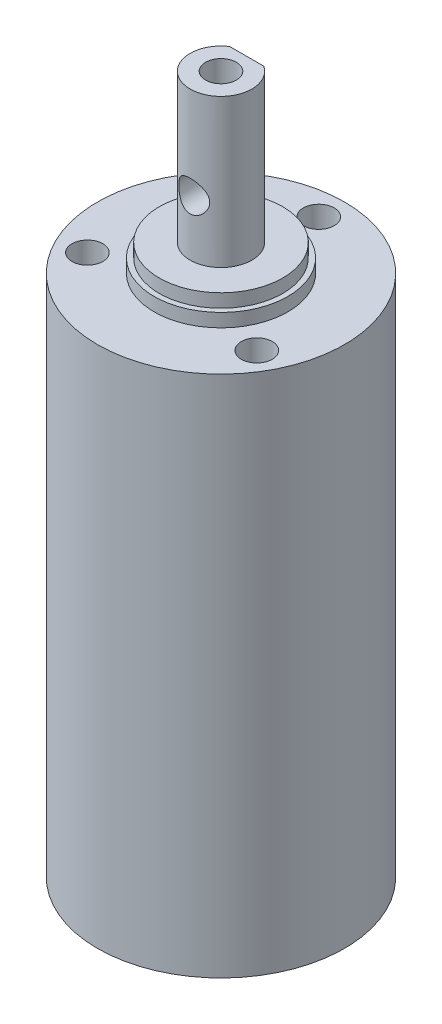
ISO-10303-21;
HEADER;
FILE_DESCRIPTION(('STEP AP214'),'2;1');
FILE_NAME('part.step','',(''),(''),'','','');
FILE_SCHEMA(('AUTOMOTIVE_DESIGN { 1 0 10303 214 1 1 1 1 }'));
ENDSEC;
DATA;
#1=APPLICATION_CONTEXT('core data for automotive mechanical design processes');
#2=APPLICATION_PROTOCOL_DEFINITION('international standard','automotive_design',2000,#1);
#3=PRODUCT_CONTEXT('',#1,'mechanical');
#4=PRODUCT('Part','Part','',(#3));
#5=PRODUCT_RELATED_PRODUCT_CATEGORY('part','',(#4));
#6=PRODUCT_DEFINITION_FORMATION('','',#4);
#7=PRODUCT_DEFINITION_CONTEXT('part definition',#1,'design');
#8=PRODUCT_DEFINITION('design','',#6,#7);
#9=PRODUCT_DEFINITION_SHAPE('','',#8);
#10=(LENGTH_UNIT() NAMED_UNIT(*) SI_UNIT(.MILLI.,.METRE.));
#11=(NAMED_UNIT(*) PLANE_ANGLE_UNIT() SI_UNIT($,.RADIAN.));
#12=(NAMED_UNIT(*) SI_UNIT($,.STERADIAN.) SOLID_ANGLE_UNIT());
#13=UNCERTAINTY_MEASURE_WITH_UNIT(LENGTH_MEASURE(1.E-05),#10,'distance_accuracy_value','');
#14=(GEOMETRIC_REPRESENTATION_CONTEXT(3) GLOBAL_UNCERTAINTY_ASSIGNED_CONTEXT((#13)) GLOBAL_UNIT_ASSIGNED_CONTEXT((#10,
#11,#12)) REPRESENTATION_CONTEXT('',''));
#15=CARTESIAN_POINT('',(0.,0.,0.));
#16=DIRECTION('',(0.,0.,1.));
#17=DIRECTION('',(1.,0.,0.));
#18=AXIS2_PLACEMENT_3D('',#15,#16,#17);
#19=CARTESIAN_POINT('',(0.,0.,0.));
#20=DIRECTION('',(0.,-1.,0.));
#21=DIRECTION('',(0.,0.,-1.));
#22=AXIS2_PLACEMENT_3D('',#19,#20,#21);
#23=CYLINDRICAL_SURFACE('',#22,3.);
#24=CARTESIAN_POINT('',(-1.5,62.8,2.59807621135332));
#25=CARTESIAN_POINT('',(-1.4999945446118,62.8781617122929,2.59808302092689));
#26=CARTESIAN_POINT('',(-1.49384995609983,62.9564221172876,2.60165701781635));
#27=CARTESIAN_POINT('',(-1.46958481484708,63.1105408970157,2.61543549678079));
#28=CARTESIAN_POINT('',(-1.45143909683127,63.1863938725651,2.62565391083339));
#29=CARTESIAN_POINT('',(-1.40414992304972,63.3331774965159,2.65124019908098));
#30=CARTESIAN_POINT('',(-1.37506492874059,63.4041319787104,2.66658065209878));
#31=CARTESIAN_POINT('',(-1.30690128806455,63.5401363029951,2.70063997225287));
#32=CARTESIAN_POINT('',(-1.26782210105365,63.6051858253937,2.71935902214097));
#33=CARTESIAN_POINT('',(-1.17699981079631,63.7334585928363,2.75995303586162));
#34=CARTESIAN_POINT('',(-1.12447805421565,63.7960887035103,2.78196095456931));
#35=CARTESIAN_POINT('',(-1.00988071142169,63.9121125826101,2.82557974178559));
#36=CARTESIAN_POINT('',(-0.947800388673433,63.9655017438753,2.84719040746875));
#37=CARTESIAN_POINT('',(-0.810734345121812,64.0650507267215,2.88932215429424));
#38=CARTESIAN_POINT('',(-0.735160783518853,64.1104806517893,2.90967159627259));
#39=CARTESIAN_POINT('',(-0.576235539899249,64.1877112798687,2.94526134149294));
#40=CARTESIAN_POINT('',(-0.49288880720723,64.2195205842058,2.96050486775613));
#41=CARTESIAN_POINT('',(-0.327067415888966,64.2662569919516,2.98320691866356));
#42=CARTESIAN_POINT('',(-0.244952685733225,64.2822242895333,2.99114220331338));
#43=CARTESIAN_POINT('',(-0.0788559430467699,64.3002491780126,3.00011375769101));
#44=CARTESIAN_POINT('',(0.00512490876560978,64.3023151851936,3.00115420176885));
#45=CARTESIAN_POINT('',(0.164748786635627,64.2928799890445,2.99644472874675));
#46=CARTESIAN_POINT('',(0.240481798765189,64.2825429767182,2.99127743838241));
#47=CARTESIAN_POINT('',(0.388970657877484,64.250678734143,2.97561367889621));
#48=CARTESIAN_POINT('',(0.461726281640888,64.2291506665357,2.96511681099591));
#49=CARTESIAN_POINT('',(0.603464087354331,64.1753761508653,2.93957374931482));
#50=CARTESIAN_POINT('',(0.67238013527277,64.1429855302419,2.92446662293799));
#51=CARTESIAN_POINT('',(0.803965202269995,64.0686048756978,2.89106468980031));
#52=CARTESIAN_POINT('',(0.86663197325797,64.0266114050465,2.87276874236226));
#53=CARTESIAN_POINT('',(0.99026049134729,63.9296569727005,2.83266591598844));
#54=CARTESIAN_POINT('',(1.05050111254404,63.873845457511,2.81069063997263));
#55=CARTESIAN_POINT('',(1.16115655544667,63.7531154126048,2.76681510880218));
#56=CARTESIAN_POINT('',(1.21156381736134,63.6881899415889,2.74491492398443));
#57=CARTESIAN_POINT('',(1.30425800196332,63.5460277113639,2.70216234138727));
#58=CARTESIAN_POINT('',(1.34582597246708,63.4682709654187,2.68146479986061));
#59=CARTESIAN_POINT('',(1.41497866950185,63.3055934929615,2.64563175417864));
#60=CARTESIAN_POINT('',(1.44257798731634,63.2206803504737,2.63049045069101));
#61=CARTESIAN_POINT('',(1.48077031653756,63.0531782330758,2.60916953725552));
#62=CARTESIAN_POINT('',(1.49253768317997,62.9709383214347,2.60237483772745));
#63=CARTESIAN_POINT('',(1.50227541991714,62.8053979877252,2.59676879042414));
#64=CARTESIAN_POINT('',(1.50025553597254,62.7220983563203,2.59795180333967));
#65=CARTESIAN_POINT('',(1.48355406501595,62.5665191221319,2.60751504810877));
#66=CARTESIAN_POINT('',(1.4702817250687,62.4940308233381,2.61509381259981));
#67=CARTESIAN_POINT('',(1.43354442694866,62.3524483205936,2.63541032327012));
#68=CARTESIAN_POINT('',(1.41007616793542,62.2833552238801,2.64814974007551));
#69=CARTESIAN_POINT('',(1.35247138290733,62.146883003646,2.67804333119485));
#70=CARTESIAN_POINT('',(1.31789109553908,62.0797314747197,2.69537464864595));
#71=CARTESIAN_POINT('',(1.2394305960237,61.9517960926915,2.73234179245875));
#72=CARTESIAN_POINT('',(1.19554560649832,61.8910155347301,2.75197880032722));
#73=CARTESIAN_POINT('',(1.09325575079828,61.7695318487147,2.79431997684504));
#74=CARTESIAN_POINT('',(1.03371790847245,61.7098042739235,2.81709874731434));
#75=CARTESIAN_POINT('',(0.905106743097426,61.6008816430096,2.86101352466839));
#76=CARTESIAN_POINT('',(0.836030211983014,61.5516901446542,2.88214897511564));
#77=CARTESIAN_POINT('',(0.687803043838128,61.4641394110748,2.92112042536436));
#78=CARTESIAN_POINT('',(0.608434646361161,61.4261003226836,2.93885462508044));
#79=CARTESIAN_POINT('',(0.443283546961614,61.3642931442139,2.96825032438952));
#80=CARTESIAN_POINT('',(0.357506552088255,61.3405125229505,2.9799171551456));
#81=CARTESIAN_POINT('',(0.190469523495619,61.309947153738,2.99501262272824));
#82=CARTESIAN_POINT('',(0.109517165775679,61.3018031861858,2.99909891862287));
#83=CARTESIAN_POINT('',(-0.0526889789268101,61.2987351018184,3.00063195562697));
#84=CARTESIAN_POINT('',(-0.133942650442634,61.3038063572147,2.99808102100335));
#85=CARTESIAN_POINT('',(-0.288806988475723,61.3261246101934,2.98700953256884));
#86=CARTESIAN_POINT('',(-0.362568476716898,61.3425472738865,2.97889342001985));
#87=CARTESIAN_POINT('',(-0.506168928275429,61.3859904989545,2.95788140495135));
#88=CARTESIAN_POINT('',(-0.576007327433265,61.4130125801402,2.94498481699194));
#89=CARTESIAN_POINT('',(-0.71313510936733,61.478090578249,2.9148889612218));
#90=CARTESIAN_POINT('',(-0.780187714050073,61.5165689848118,2.89752925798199));
#91=CARTESIAN_POINT('',(-0.907161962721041,61.6029368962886,2.86032199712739));
#92=CARTESIAN_POINT('',(-0.967080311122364,61.6508307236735,2.84047329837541));
#93=CARTESIAN_POINT('',(-1.08437100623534,61.7601957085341,2.79792915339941));
#94=CARTESIAN_POINT('',(-1.14089652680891,61.8225437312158,2.77514698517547));
#95=CARTESIAN_POINT('',(-1.24299493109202,61.9561760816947,2.73094614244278));
#96=CARTESIAN_POINT('',(-1.28855812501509,62.0274682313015,2.70952868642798));
#97=CARTESIAN_POINT('',(-1.36864661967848,62.1799549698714,2.66999407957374));
#98=CARTESIAN_POINT('',(-1.40277759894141,62.2613912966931,2.65200261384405));
#99=CARTESIAN_POINT('',(-1.45631806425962,62.4299986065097,2.62299234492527));
#100=CARTESIAN_POINT('',(-1.47577678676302,62.517149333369,2.61195024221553));
#101=CARTESIAN_POINT('',(-1.49155051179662,62.637708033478,2.60293908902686));
#102=CARTESIAN_POINT('',(-1.49471415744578,62.6700518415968,2.60112193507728));
#103=CARTESIAN_POINT('',(-1.49894010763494,62.7349247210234,2.59868903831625));
#104=CARTESIAN_POINT('',(-1.50000227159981,62.7674538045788,2.59807337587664));
#105=CARTESIAN_POINT('',(-1.5,62.8,2.59807621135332));
#106=B_SPLINE_CURVE_WITH_KNOTS('',3,(#24,#25,#26,#27,#28,#29,#30,#31,#32,#33,#34,#35,#36,#37,
#38,#39,#40,#41,#42,#43,#44,#45,#46,#47,#48,#49,#50,#51,#52,#53,#54,#55,#56,#57,#58,#59,#60,#61,
#62,#63,#64,#65,#66,#67,#68,#69,#70,#71,#72,#73,#74,#75,#76,#77,#78,#79,#80,#81,#82,#83,#84,#85,
#86,#87,#88,#89,#90,#91,#92,#93,#94,#95,#96,#97,#98,#99,#100,#101,#102,#103,#104,#105),
.UNSPECIFIED.,.T.,.F.,(4,2,2,2,2,2,2,2,2,2,2,2,2,2,2,2,2,2,2,2,2,2,2,2,2,2,2,2,2,2,2,2,2,2,2,2,
2,2,2,2,4),(0.,0.234348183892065,0.469189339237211,0.702792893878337,0.936409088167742,
1.18929346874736,1.44230356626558,1.71236838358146,1.98226240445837,2.23295227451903,
2.4834903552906,2.71224146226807,2.94100968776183,3.1729430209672,3.40495949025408,
3.65890787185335,3.91305072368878,4.18333262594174,4.45333161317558,4.70193436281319,
4.95036139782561,5.17161275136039,5.39293578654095,5.62450944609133,5.85620229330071,
6.11710115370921,6.37808797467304,6.6459627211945,6.91360169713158,7.15668405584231,
7.39968130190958,7.62666637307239,7.8536840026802,8.09041126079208,8.32724745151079,
8.58765362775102,8.84828914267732,9.11716123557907,9.38512699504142,9.48270202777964,
9.58028358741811),.UNSPECIFIED.);
#107=CARTESIAN_POINT('',(-1.5,62.8,2.59807621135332));
#108=VERTEX_POINT('',#107);
#109=EDGE_CURVE('E72',#108,#108,#106,.T.);
#110=ORIENTED_EDGE('',*,*,#109,.T.);
#111=EDGE_LOOP('',(#110));
#112=FACE_BOUND('',#111,.T.);
#113=DIRECTION('',(0.,-1.,0.));
#114=VECTOR('',#113,1.);
#115=CARTESIAN_POINT('',(1.6583123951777,260.822667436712,-2.5));
#116=LINE('',#115,#114);
#117=CARTESIAN_POINT('',(1.6583123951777,71.8,-2.5));
#118=VERTEX_POINT('',#117);
#119=CARTESIAN_POINT('',(1.6583123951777,57.4,-2.5));
#120=VERTEX_POINT('',#119);
#121=EDGE_CURVE('E66',#118,#120,#116,.T.);
#122=ORIENTED_EDGE('',*,*,#121,.F.);
#123=CARTESIAN_POINT('',(0.,71.8,0.));
#124=DIRECTION('',(0.,-1.,0.));
#125=DIRECTION('',(0.,0.,-1.));
#126=AXIS2_PLACEMENT_3D('',#123,#124,#125);
#127=CIRCLE('',#126,3.);
#128=CARTESIAN_POINT('',(-1.6583123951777,71.8,-2.5));
#129=VERTEX_POINT('',#128);
#130=EDGE_CURVE('E60',#118,#129,#127,.T.);
#131=ORIENTED_EDGE('',*,*,#130,.T.);
#132=DIRECTION('',(0.,-1.,0.));
#133=VECTOR('',#132,1.);
#134=CARTESIAN_POINT('',(-1.6583123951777,260.822667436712,-2.5));
#135=LINE('',#134,#133);
#136=CARTESIAN_POINT('',(-1.6583123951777,57.4,-2.5));
#137=VERTEX_POINT('',#136);
#138=EDGE_CURVE('E48',#129,#137,#135,.T.);
#139=ORIENTED_EDGE('',*,*,#138,.T.);
#140=CARTESIAN_POINT('',(0.,57.4,0.));
#141=DIRECTION('',(0.,-1.,0.));
#142=DIRECTION('',(0.,0.,-1.));
#143=AXIS2_PLACEMENT_3D('',#140,#141,#142);
#144=CIRCLE('',#143,3.);
#145=EDGE_CURVE('E52',#120,#137,#144,.T.);
#146=ORIENTED_EDGE('',*,*,#145,.F.);
#147=EDGE_LOOP('',(#122,#131,#139,#146));
#148=FACE_BOUND('',#147,.T.);
#149=ADVANCED_FACE('F33',(#112,#148),#23,.T.);
#150=CARTESIAN_POINT('',(0.,71.8,0.));
#151=DIRECTION('',(0.,-1.,0.));
#152=DIRECTION('',(0.,0.,-1.));
#153=AXIS2_PLACEMENT_3D('',#150,#151,#152);
#154=PLANE('',#153);
#155=CARTESIAN_POINT('',(0.,71.8,0.));
#156=DIRECTION('',(0.,1.,0.));
#157=DIRECTION('',(0.,0.,1.));
#158=AXIS2_PLACEMENT_3D('',#155,#156,#157);
#159=CIRCLE('',#158,1.5);
#160=CARTESIAN_POINT('',(0.,71.8,1.5));
#161=VERTEX_POINT('',#160);
#162=EDGE_CURVE('E206',#161,#161,#159,.T.);
#163=ORIENTED_EDGE('',*,*,#162,.F.);
#164=EDGE_LOOP('',(#163));
#165=FACE_BOUND('',#164,.T.);
#166=DIRECTION('',(-1.,0.,0.));
#167=VECTOR('',#166,1.);
#168=CARTESIAN_POINT('',(-1.6583123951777,71.8,-2.5));
#169=LINE('',#168,#167);
#170=EDGE_CURVE('E63',#118,#129,#169,.T.);
#171=ORIENTED_EDGE('',*,*,#170,.T.);
#172=ORIENTED_EDGE('',*,*,#130,.F.);
#173=EDGE_LOOP('',(#171,#172));
#174=FACE_BOUND('',#173,.T.);
#175=ADVANCED_FACE('F61',(#165,#174),#154,.F.);
#176=CARTESIAN_POINT('',(0.,0.,0.));
#177=DIRECTION('',(0.,-1.,0.));
#178=DIRECTION('',(0.,0.,-1.));
#179=AXIS2_PLACEMENT_3D('',#176,#177,#178);
#180=PLANE('',#179);
#181=CARTESIAN_POINT('',(0.,0.,0.));
#182=DIRECTION('',(0.,-1.,0.));
#183=DIRECTION('',(0.,0.,-1.));
#184=AXIS2_PLACEMENT_3D('',#181,#182,#183);
#185=CIRCLE('',#184,3.);
#186=CARTESIAN_POINT('',(0.,0.,-3.));
#187=VERTEX_POINT('',#186);
#188=EDGE_CURVE('E11',#187,#187,#185,.T.);
#189=ORIENTED_EDGE('',*,*,#188,.T.);
#190=EDGE_LOOP('',(#189));
#191=FACE_BOUND('',#190,.T.);
#192=ADVANCED_FACE('F35',(#191),#180,.T.);
#193=CARTESIAN_POINT('',(0.,0.,0.));
#194=DIRECTION('',(0.,-1.,0.));
#195=DIRECTION('',(0.,0.,-1.));
#196=AXIS2_PLACEMENT_3D('',#193,#194,#195);
#197=CYLINDRICAL_SURFACE('',#196,3.);
#198=CARTESIAN_POINT('',(0.,4.,0.));
#199=DIRECTION('',(0.,-1.,0.));
#200=DIRECTION('',(0.,0.,-1.));
#201=AXIS2_PLACEMENT_3D('',#198,#199,#200);
#202=CIRCLE('',#201,3.);
#203=CARTESIAN_POINT('',(0.,4.,-3.));
#204=VERTEX_POINT('',#203);
#205=EDGE_CURVE('E41',#204,#204,#202,.T.);
#206=ORIENTED_EDGE('',*,*,#205,.T.);
#207=EDGE_LOOP('',(#206));
#208=FACE_BOUND('',#207,.T.);
#209=ORIENTED_EDGE('',*,*,#188,.F.);
#210=EDGE_LOOP('',(#209));
#211=FACE_BOUND('',#210,.T.);
#212=ADVANCED_FACE('F101',(#208,#211),#197,.T.);
#213=CARTESIAN_POINT('',(0.,4.,0.));
#214=DIRECTION('',(0.,1.,0.));
#215=DIRECTION('',(0.,0.,1.));
#216=AXIS2_PLACEMENT_3D('',#213,#214,#215);
#217=PLANE('',#216);
#218=ORIENTED_EDGE('',*,*,#205,.F.);
#219=EDGE_LOOP('',(#218));
#220=FACE_BOUND('',#219,.T.);
#221=CARTESIAN_POINT('',(0.,4.,0.));
#222=DIRECTION('',(0.,-1.,0.));
#223=DIRECTION('',(0.,0.,-1.));
#224=AXIS2_PLACEMENT_3D('',#221,#222,#223);
#225=CIRCLE('',#224,12.);
#226=CARTESIAN_POINT('',(0.,4.,-12.));
#227=VERTEX_POINT('',#226);
#228=EDGE_CURVE('E96',#227,#227,#225,.T.);
#229=ORIENTED_EDGE('',*,*,#228,.T.);
#230=EDGE_LOOP('',(#229));
#231=FACE_BOUND('',#230,.T.);
#232=ADVANCED_FACE('F104',(#220,#231),#217,.F.);
#233=CARTESIAN_POINT('',(0.,0.,0.));
#234=DIRECTION('',(0.,-1.,0.));
#235=DIRECTION('',(0.,0.,-1.));
#236=AXIS2_PLACEMENT_3D('',#233,#234,#235);
#237=CYLINDRICAL_SURFACE('',#236,12.);
#238=ORIENTED_EDGE('',*,*,#228,.F.);
#239=EDGE_LOOP('',(#238));
#240=FACE_BOUND('',#239,.T.);
#241=CARTESIAN_POINT('',(0.,54.8,0.));
#242=DIRECTION('',(0.,-1.,0.));
#243=DIRECTION('',(0.,0.,-1.));
#244=AXIS2_PLACEMENT_3D('',#241,#242,#243);
#245=CIRCLE('',#244,12.);
#246=CARTESIAN_POINT('',(0.,54.8,-12.));
#247=VERTEX_POINT('',#246);
#248=EDGE_CURVE('E93',#247,#247,#245,.T.);
#249=ORIENTED_EDGE('',*,*,#248,.T.);
#250=EDGE_LOOP('',(#249));
#251=FACE_BOUND('',#250,.T.);
#252=ADVANCED_FACE('F107',(#240,#251),#237,.T.);
#253=CARTESIAN_POINT('',(0.,54.8,0.));
#254=DIRECTION('',(0.,-1.,0.));
#255=DIRECTION('',(0.,0.,-1.));
#256=AXIS2_PLACEMENT_3D('',#253,#254,#255);
#257=PLANE('',#256);
#258=CARTESIAN_POINT('',(0.,54.8,-9.5));
#259=DIRECTION('',(0.,1.,0.));
#260=DIRECTION('',(0.,0.,1.));
#261=AXIS2_PLACEMENT_3D('',#258,#259,#260);
#262=CIRCLE('',#261,1.5);
#263=CARTESIAN_POINT('',(0.,54.8,-8.));
#264=VERTEX_POINT('',#263);
#265=EDGE_CURVE('E207',#264,#264,#262,.T.);
#266=ORIENTED_EDGE('',*,*,#265,.F.);
#267=EDGE_LOOP('',(#266));
#268=FACE_BOUND('',#267,.T.);
#269=CARTESIAN_POINT('',(8.22724133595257,54.8,4.74999999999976));
#270=DIRECTION('',(0.,1.,0.));
#271=DIRECTION('',(0.,0.,1.));
#272=AXIS2_PLACEMENT_3D('',#269,#270,#271);
#273=CIRCLE('',#272,1.50000000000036);
#274=CARTESIAN_POINT('',(8.22724133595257,54.8,6.25000000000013));
#275=VERTEX_POINT('',#274);
#276=EDGE_CURVE('E217',#275,#275,#273,.T.);
#277=ORIENTED_EDGE('',*,*,#276,.F.);
#278=EDGE_LOOP('',(#277));
#279=FACE_BOUND('',#278,.T.);
#280=CARTESIAN_POINT('',(-8.22724133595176,54.8,4.75000000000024));
#281=DIRECTION('',(0.,1.,0.));
#282=DIRECTION('',(0.,0.,1.));
#283=AXIS2_PLACEMENT_3D('',#280,#281,#282);
#284=CIRCLE('',#283,1.50000000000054);
#285=CARTESIAN_POINT('',(-8.22724133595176,54.8,6.25000000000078));
#286=VERTEX_POINT('',#285);
#287=EDGE_CURVE('E223',#286,#286,#284,.T.);
#288=ORIENTED_EDGE('',*,*,#287,.F.);
#289=EDGE_LOOP('',(#288));
#290=FACE_BOUND('',#289,.T.);
#291=ORIENTED_EDGE('',*,*,#248,.F.);
#292=EDGE_LOOP('',(#291));
#293=FACE_BOUND('',#292,.T.);
#294=CARTESIAN_POINT('',(0.,54.8,0.));
#295=DIRECTION('',(0.,-1.,0.));
#296=DIRECTION('',(0.,0.,-1.));
#297=AXIS2_PLACEMENT_3D('',#294,#295,#296);
#298=CIRCLE('',#297,6.5);
#299=CARTESIAN_POINT('',(0.,54.8,-6.5));
#300=VERTEX_POINT('',#299);
#301=EDGE_CURVE('E90',#300,#300,#298,.T.);
#302=ORIENTED_EDGE('',*,*,#301,.T.);
#303=EDGE_LOOP('',(#302));
#304=FACE_BOUND('',#303,.T.);
#305=ADVANCED_FACE('F113',(#268,#279,#290,#293,#304),#257,.F.);
#306=CARTESIAN_POINT('',(0.,0.,0.));
#307=DIRECTION('',(0.,-1.,0.));
#308=DIRECTION('',(0.,0.,-1.));
#309=AXIS2_PLACEMENT_3D('',#306,#307,#308);
#310=CYLINDRICAL_SURFACE('',#309,6.5);
#311=ORIENTED_EDGE('',*,*,#301,.F.);
#312=EDGE_LOOP('',(#311));
#313=FACE_BOUND('',#312,.T.);
#314=CARTESIAN_POINT('',(0.,56.1,0.));
#315=DIRECTION('',(0.,-1.,0.));
#316=DIRECTION('',(0.,0.,-1.));
#317=AXIS2_PLACEMENT_3D('',#314,#315,#316);
#318=CIRCLE('',#317,6.5);
#319=CARTESIAN_POINT('',(0.,56.1,-6.5));
#320=VERTEX_POINT('',#319);
#321=EDGE_CURVE('E87',#320,#320,#318,.T.);
#322=ORIENTED_EDGE('',*,*,#321,.T.);
#323=EDGE_LOOP('',(#322));
#324=FACE_BOUND('',#323,.T.);
#325=ADVANCED_FACE('F119',(#313,#324),#310,.T.);
#326=CARTESIAN_POINT('',(0.,56.1,0.));
#327=DIRECTION('',(0.,-1.,0.));
#328=DIRECTION('',(0.,0.,-1.));
#329=AXIS2_PLACEMENT_3D('',#326,#327,#328);
#330=PLANE('',#329);
#331=ORIENTED_EDGE('',*,*,#321,.F.);
#332=EDGE_LOOP('',(#331));
#333=FACE_BOUND('',#332,.T.);
#334=CARTESIAN_POINT('',(0.,56.1,0.));
#335=DIRECTION('',(0.,-1.,0.));
#336=DIRECTION('',(0.,0.,-1.));
#337=AXIS2_PLACEMENT_3D('',#334,#335,#336);
#338=CIRCLE('',#337,6.);
#339=CARTESIAN_POINT('',(0.,56.1,-6.));
#340=VERTEX_POINT('',#339);
#341=EDGE_CURVE('E84',#340,#340,#338,.T.);
#342=ORIENTED_EDGE('',*,*,#341,.T.);
#343=EDGE_LOOP('',(#342));
#344=FACE_BOUND('',#343,.T.);
#345=ADVANCED_FACE('F126',(#333,#344),#330,.F.);
#346=CARTESIAN_POINT('',(0.,0.,0.));
#347=DIRECTION('',(0.,-1.,0.));
#348=DIRECTION('',(0.,0.,-1.));
#349=AXIS2_PLACEMENT_3D('',#346,#347,#348);
#350=CYLINDRICAL_SURFACE('',#349,6.);
#351=ORIENTED_EDGE('',*,*,#341,.F.);
#352=EDGE_LOOP('',(#351));
#353=FACE_BOUND('',#352,.T.);
#354=CARTESIAN_POINT('',(0.,57.4,0.));
#355=DIRECTION('',(0.,-1.,0.));
#356=DIRECTION('',(0.,0.,-1.));
#357=AXIS2_PLACEMENT_3D('',#354,#355,#356);
#358=CIRCLE('',#357,6.);
#359=CARTESIAN_POINT('',(0.,57.4,-6.));
#360=VERTEX_POINT('',#359);
#361=EDGE_CURVE('E81',#360,#360,#358,.T.);
#362=ORIENTED_EDGE('',*,*,#361,.T.);
#363=EDGE_LOOP('',(#362));
#364=FACE_BOUND('',#363,.T.);
#365=ADVANCED_FACE('F132',(#353,#364),#350,.T.);
#366=CARTESIAN_POINT('',(0.,57.4,0.));
#367=DIRECTION('',(0.,-1.,0.));
#368=DIRECTION('',(0.,0.,-1.));
#369=AXIS2_PLACEMENT_3D('',#366,#367,#368);
#370=PLANE('',#369);
#371=ORIENTED_EDGE('',*,*,#361,.F.);
#372=EDGE_LOOP('',(#371));
#373=FACE_BOUND('',#372,.T.);
#374=ORIENTED_EDGE('',*,*,#145,.T.);
#375=DIRECTION('',(-1.,0.,0.));
#376=VECTOR('',#375,1.);
#377=CARTESIAN_POINT('',(-1.6583123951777,57.4,-2.5));
#378=LINE('',#377,#376);
#379=EDGE_CURVE('E69',#120,#137,#378,.T.);
#380=ORIENTED_EDGE('',*,*,#379,.F.);
#381=EDGE_LOOP('',(#374,#380));
#382=FACE_BOUND('',#381,.T.);
#383=ADVANCED_FACE('F138',(#373,#382),#370,.F.);
#384=CARTESIAN_POINT('',(-1.6583123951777,260.822667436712,-2.5));
#385=DIRECTION('',(0.,0.,-1.));
#386=DIRECTION('',(-1.,0.,0.));
#387=AXIS2_PLACEMENT_3D('',#384,#385,#386);
#388=PLANE('',#387);
#389=CARTESIAN_POINT('',(0.,62.8,-2.5));
#390=DIRECTION('',(0.,0.,-1.));
#391=DIRECTION('',(-1.,0.,0.));
#392=AXIS2_PLACEMENT_3D('',#389,#390,#391);
#393=CIRCLE('',#392,1.5);
#394=CARTESIAN_POINT('',(-1.5,62.8,-2.5));
#395=VERTEX_POINT('',#394);
#396=EDGE_CURVE('E76',#395,#395,#393,.T.);
#397=ORIENTED_EDGE('',*,*,#396,.F.);
#398=EDGE_LOOP('',(#397));
#399=FACE_BOUND('',#398,.T.);
#400=ORIENTED_EDGE('',*,*,#170,.F.);
#401=ORIENTED_EDGE('',*,*,#121,.T.);
#402=ORIENTED_EDGE('',*,*,#379,.T.);
#403=ORIENTED_EDGE('',*,*,#138,.F.);
#404=EDGE_LOOP('',(#400,#401,#402,#403));
#405=FACE_BOUND('',#404,.T.);
#406=ADVANCED_FACE('F71',(#399,#405),#388,.T.);
#407=CARTESIAN_POINT('',(0.,62.8,12.));
#408=DIRECTION('',(0.,0.,-1.));
#409=DIRECTION('',(-1.,0.,0.));
#410=AXIS2_PLACEMENT_3D('',#407,#408,#409);
#411=CYLINDRICAL_SURFACE('',#410,1.5);
#412=ORIENTED_EDGE('',*,*,#396,.T.);
#413=EDGE_LOOP('',(#412));
#414=FACE_BOUND('',#413,.T.);
#415=ORIENTED_EDGE('',*,*,#109,.F.);
#416=EDGE_LOOP('',(#415));
#417=FACE_BOUND('',#416,.T.);
#418=ADVANCED_FACE('F148',(#414,#417),#411,.F.);
#419=CARTESIAN_POINT('',(0.,66.3,0.));
#420=DIRECTION('',(0.,1.,0.));
#421=DIRECTION('',(0.,0.,1.));
#422=AXIS2_PLACEMENT_3D('',#419,#420,#421);
#423=CYLINDRICAL_SURFACE('',#422,1.5);
#424=CARTESIAN_POINT('',(0.,66.3,0.));
#425=DIRECTION('',(0.,1.,0.));
#426=DIRECTION('',(0.,0.,1.));
#427=AXIS2_PLACEMENT_3D('',#424,#425,#426);
#428=CIRCLE('',#427,1.5);
#429=CARTESIAN_POINT('',(0.,66.3,1.5));
#430=VERTEX_POINT('',#429);
#431=EDGE_CURVE('E210',#430,#430,#428,.T.);
#432=ORIENTED_EDGE('',*,*,#431,.F.);
#433=EDGE_LOOP('',(#432));
#434=FACE_BOUND('',#433,.T.);
#435=ORIENTED_EDGE('',*,*,#162,.T.);
#436=EDGE_LOOP('',(#435));
#437=FACE_BOUND('',#436,.T.);
#438=ADVANCED_FACE('F169',(#434,#437),#423,.F.);
#439=CARTESIAN_POINT('',(0.,66.3,0.));
#440=DIRECTION('',(0.,1.,0.));
#441=DIRECTION('',(0.,0.,1.));
#442=AXIS2_PLACEMENT_3D('',#439,#440,#441);
#443=PLANE('',#442);
#444=ORIENTED_EDGE('',*,*,#431,.T.);
#445=EDGE_LOOP('',(#444));
#446=FACE_BOUND('',#445,.T.);
#447=ADVANCED_FACE('F173',(#446),#443,.T.);
#448=CARTESIAN_POINT('',(-8.22724133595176,50.8,4.75000000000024));
#449=DIRECTION('',(0.,1.,0.));
#450=DIRECTION('',(0.,0.,1.));
#451=AXIS2_PLACEMENT_3D('',#448,#449,#450);
#452=CYLINDRICAL_SURFACE('',#451,1.50000000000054);
#453=CARTESIAN_POINT('',(-8.22724133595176,50.8,4.75000000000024));
#454=DIRECTION('',(0.,1.,0.));
#455=DIRECTION('',(0.,0.,1.));
#456=AXIS2_PLACEMENT_3D('',#453,#454,#455);
#457=CIRCLE('',#456,1.50000000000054);
#458=CARTESIAN_POINT('',(-8.22724133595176,50.8,6.25000000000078));
#459=VERTEX_POINT('',#458);
#460=EDGE_CURVE('E220',#459,#459,#457,.T.);
#461=ORIENTED_EDGE('',*,*,#460,.F.);
#462=EDGE_LOOP('',(#461));
#463=FACE_BOUND('',#462,.T.);
#464=ORIENTED_EDGE('',*,*,#287,.T.);
#465=EDGE_LOOP('',(#464));
#466=FACE_BOUND('',#465,.T.);
#467=ADVANCED_FACE('F177',(#463,#466),#452,.F.);
#468=CARTESIAN_POINT('',(-8.22724133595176,50.8,4.75000000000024));
#469=DIRECTION('',(0.,1.,0.));
#470=DIRECTION('',(0.,0.,1.));
#471=AXIS2_PLACEMENT_3D('',#468,#469,#470);
#472=PLANE('',#471);
#473=ORIENTED_EDGE('',*,*,#460,.T.);
#474=EDGE_LOOP('',(#473));
#475=FACE_BOUND('',#474,.T.);
#476=ADVANCED_FACE('F181',(#475),#472,.T.);
#477=CARTESIAN_POINT('',(8.22724133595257,50.8,4.74999999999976));
#478=DIRECTION('',(0.,1.,0.));
#479=DIRECTION('',(0.,0.,1.));
#480=AXIS2_PLACEMENT_3D('',#477,#478,#479);
#481=CYLINDRICAL_SURFACE('',#480,1.50000000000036);
#482=CARTESIAN_POINT('',(8.22724133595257,50.8,4.74999999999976));
#483=DIRECTION('',(0.,1.,0.));
#484=DIRECTION('',(0.,0.,1.));
#485=AXIS2_PLACEMENT_3D('',#482,#483,#484);
#486=CIRCLE('',#485,1.50000000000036);
#487=CARTESIAN_POINT('',(8.22724133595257,50.8,6.25000000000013));
#488=VERTEX_POINT('',#487);
#489=EDGE_CURVE('E212',#488,#488,#486,.T.);
#490=ORIENTED_EDGE('',*,*,#489,.F.);
#491=EDGE_LOOP('',(#490));
#492=FACE_BOUND('',#491,.T.);
#493=ORIENTED_EDGE('',*,*,#276,.T.);
#494=EDGE_LOOP('',(#493));
#495=FACE_BOUND('',#494,.T.);
#496=ADVANCED_FACE('F185',(#492,#495),#481,.F.);
#497=CARTESIAN_POINT('',(8.22724133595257,50.8,4.74999999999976));
#498=DIRECTION('',(0.,1.,0.));
#499=DIRECTION('',(0.,0.,1.));
#500=AXIS2_PLACEMENT_3D('',#497,#498,#499);
#501=PLANE('',#500);
#502=ORIENTED_EDGE('',*,*,#489,.T.);
#503=EDGE_LOOP('',(#502));
#504=FACE_BOUND('',#503,.T.);
#505=ADVANCED_FACE('F189',(#504),#501,.T.);
#506=CARTESIAN_POINT('',(0.,50.8,-9.5));
#507=DIRECTION('',(0.,1.,0.));
#508=DIRECTION('',(0.,0.,1.));
#509=AXIS2_PLACEMENT_3D('',#506,#507,#508);
#510=CYLINDRICAL_SURFACE('',#509,1.5);
#511=CARTESIAN_POINT('',(0.,50.8,-9.5));
#512=DIRECTION('',(0.,1.,0.));
#513=DIRECTION('',(0.,0.,1.));
#514=AXIS2_PLACEMENT_3D('',#511,#512,#513);
#515=CIRCLE('',#514,1.5);
#516=CARTESIAN_POINT('',(0.,50.8,-8.));
#517=VERTEX_POINT('',#516);
#518=EDGE_CURVE('E205',#517,#517,#515,.T.);
#519=ORIENTED_EDGE('',*,*,#518,.F.);
#520=EDGE_LOOP('',(#519));
#521=FACE_BOUND('',#520,.T.);
#522=ORIENTED_EDGE('',*,*,#265,.T.);
#523=EDGE_LOOP('',(#522));
#524=FACE_BOUND('',#523,.T.);
#525=ADVANCED_FACE('F193',(#521,#524),#510,.F.);
#526=CARTESIAN_POINT('',(0.,50.8,-9.5));
#527=DIRECTION('',(0.,1.,0.));
#528=DIRECTION('',(0.,0.,1.));
#529=AXIS2_PLACEMENT_3D('',#526,#527,#528);
#530=PLANE('',#529);
#531=ORIENTED_EDGE('',*,*,#518,.T.);
#532=EDGE_LOOP('',(#531));
#533=FACE_BOUND('',#532,.T.);
#534=ADVANCED_FACE('F197',(#533),#530,.T.);
#535=CLOSED_SHELL('',(#149,#175,#192,#212,#232,#252,#305,#325,#345,#365,#383,#406,#418,#438,
#447,#467,#476,#496,#505,#525,#534));
#536=MANIFOLD_SOLID_BREP('B2',#535);
#537=ADVANCED_BREP_SHAPE_REPRESENTATION('',(#18,#536),#14);
#538=SHAPE_DEFINITION_REPRESENTATION(#9,#537);
ENDSEC;
END-ISO-10303-21;
